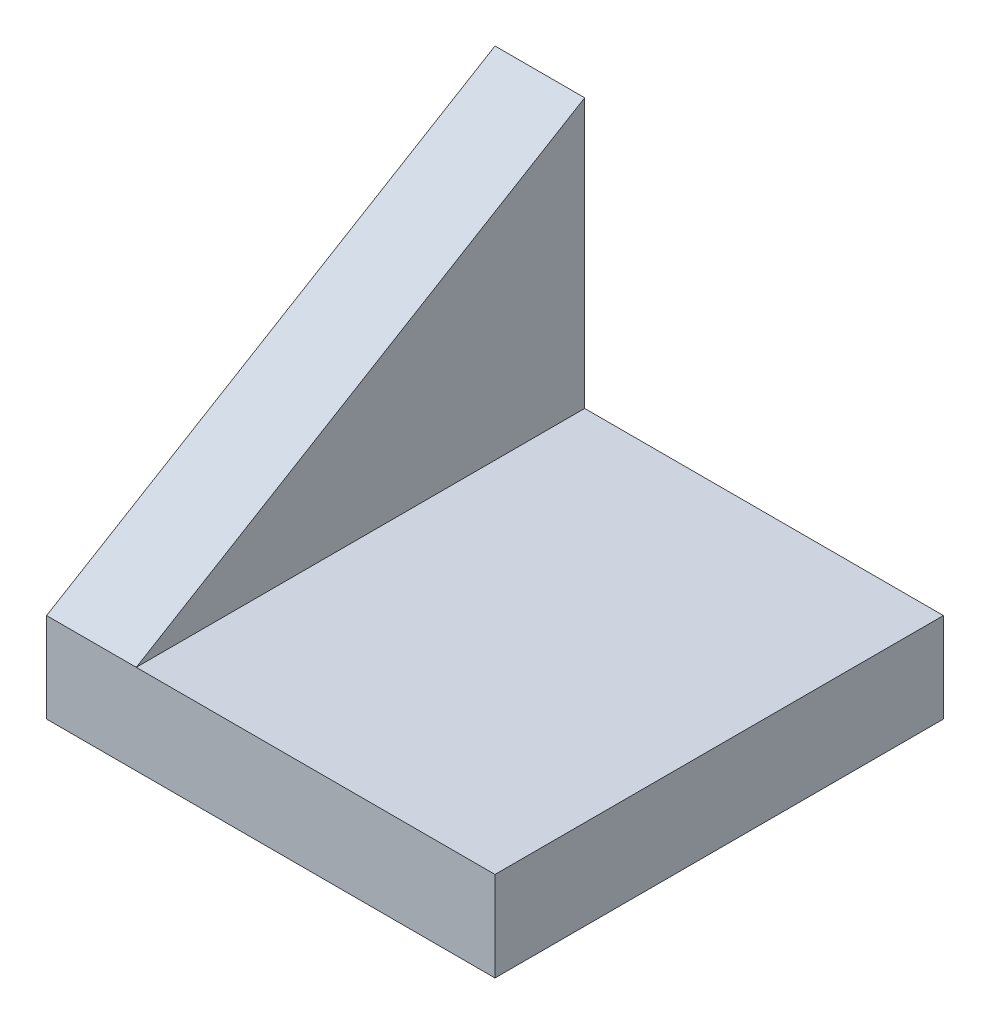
ISO-10303-21;
HEADER;
FILE_DESCRIPTION(('STEP AP214'),'2;1');
FILE_NAME('part.step','',(''),(''),'','','');
FILE_SCHEMA(('AUTOMOTIVE_DESIGN { 1 0 10303 214 1 1 1 1 }'));
ENDSEC;
DATA;
#1=APPLICATION_CONTEXT('core data for automotive mechanical design processes');
#2=APPLICATION_PROTOCOL_DEFINITION('international standard','automotive_design',2000,#1);
#3=PRODUCT_CONTEXT('',#1,'mechanical');
#4=PRODUCT('Part','Part','',(#3));
#5=PRODUCT_RELATED_PRODUCT_CATEGORY('part','',(#4));
#6=PRODUCT_DEFINITION_FORMATION('','',#4);
#7=PRODUCT_DEFINITION_CONTEXT('part definition',#1,'design');
#8=PRODUCT_DEFINITION('design','',#6,#7);
#9=PRODUCT_DEFINITION_SHAPE('','',#8);
#10=(LENGTH_UNIT() NAMED_UNIT(*) SI_UNIT(.MILLI.,.METRE.));
#11=(NAMED_UNIT(*) PLANE_ANGLE_UNIT() SI_UNIT($,.RADIAN.));
#12=(NAMED_UNIT(*) SI_UNIT($,.STERADIAN.) SOLID_ANGLE_UNIT());
#13=UNCERTAINTY_MEASURE_WITH_UNIT(LENGTH_MEASURE(1.E-05),#10,'distance_accuracy_value','');
#14=(GEOMETRIC_REPRESENTATION_CONTEXT(3) GLOBAL_UNCERTAINTY_ASSIGNED_CONTEXT((#13)) GLOBAL_UNIT_ASSIGNED_CONTEXT((#10,
#11,#12)) REPRESENTATION_CONTEXT('',''));
#15=CARTESIAN_POINT('',(0.,0.,0.));
#16=DIRECTION('',(0.,0.,1.));
#17=DIRECTION('',(1.,0.,0.));
#18=AXIS2_PLACEMENT_3D('',#15,#16,#17);
#19=CARTESIAN_POINT('',(-25.9453781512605,10.,-18.2773109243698));
#20=DIRECTION('',(0.,0.,-1.));
#21=DIRECTION('',(-1.,0.,0.));
#22=AXIS2_PLACEMENT_3D('',#19,#20,#21);
#23=PLANE('',#22);
#24=DIRECTION('',(1.,0.,0.));
#25=VECTOR('',#24,1.);
#26=CARTESIAN_POINT('',(-25.9453781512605,0.,-18.2773109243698));
#27=LINE('',#26,#25);
#28=CARTESIAN_POINT('',(-25.9453781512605,0.,-18.2773109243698));
#29=VERTEX_POINT('',#28);
#30=CARTESIAN_POINT('',(24.0546218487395,0.,-18.2773109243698));
#31=VERTEX_POINT('',#30);
#32=EDGE_CURVE('E93',#29,#31,#27,.T.);
#33=ORIENTED_EDGE('',*,*,#32,.F.);
#34=DIRECTION('',(0.,-1.,0.));
#35=VECTOR('',#34,1.);
#36=CARTESIAN_POINT('',(-25.9453781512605,10.,-18.2773109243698));
#37=LINE('',#36,#35);
#38=CARTESIAN_POINT('',(-25.9453781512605,40.,-18.2773109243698));
#39=VERTEX_POINT('',#38);
#40=EDGE_CURVE('E11',#39,#29,#37,.T.);
#41=ORIENTED_EDGE('',*,*,#40,.F.);
#42=DIRECTION('',(-1.,0.,0.));
#43=VECTOR('',#42,1.);
#44=CARTESIAN_POINT('',(-15.9453781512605,40.,-18.2773109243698));
#45=LINE('',#44,#43);
#46=CARTESIAN_POINT('',(-15.9453781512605,40.,-18.2773109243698));
#47=VERTEX_POINT('',#46);
#48=EDGE_CURVE('E101',#47,#39,#45,.T.);
#49=ORIENTED_EDGE('',*,*,#48,.F.);
#50=DIRECTION('',(0.,-1.,0.));
#51=VECTOR('',#50,1.);
#52=CARTESIAN_POINT('',(-15.9453781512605,10.,-18.2773109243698));
#53=LINE('',#52,#51);
#54=CARTESIAN_POINT('',(-15.9453781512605,10.,-18.2773109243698));
#55=VERTEX_POINT('',#54);
#56=EDGE_CURVE('E104',#47,#55,#53,.T.);
#57=ORIENTED_EDGE('',*,*,#56,.T.);
#58=DIRECTION('',(1.,0.,0.));
#59=VECTOR('',#58,1.);
#60=CARTESIAN_POINT('',(-25.9453781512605,10.,-18.2773109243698));
#61=LINE('',#60,#59);
#62=CARTESIAN_POINT('',(24.0546218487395,10.,-18.2773109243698));
#63=VERTEX_POINT('',#62);
#64=EDGE_CURVE('E96',#55,#63,#61,.T.);
#65=ORIENTED_EDGE('',*,*,#64,.T.);
#66=DIRECTION('',(0.,-1.,0.));
#67=VECTOR('',#66,1.);
#68=CARTESIAN_POINT('',(24.0546218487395,10.,-18.2773109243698));
#69=LINE('',#68,#67);
#70=EDGE_CURVE('E35',#63,#31,#69,.T.);
#71=ORIENTED_EDGE('',*,*,#70,.T.);
#72=EDGE_LOOP('',(#33,#41,#49,#57,#65,#71));
#73=FACE_BOUND('',#72,.T.);
#74=ADVANCED_FACE('F32',(#73),#23,.T.);
#75=CARTESIAN_POINT('',(-25.9453781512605,10.,-18.2773109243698));
#76=DIRECTION('',(1.,0.,0.));
#77=DIRECTION('',(0.,0.,-1.));
#78=AXIS2_PLACEMENT_3D('',#75,#76,#77);
#79=PLANE('',#78);
#80=DIRECTION('',(0.,0.,1.));
#81=VECTOR('',#80,1.);
#82=CARTESIAN_POINT('',(-25.9453781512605,0.,-18.2773109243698));
#83=LINE('',#82,#81);
#84=CARTESIAN_POINT('',(-25.9453781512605,0.,31.7226890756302));
#85=VERTEX_POINT('',#84);
#86=EDGE_CURVE('E79',#29,#85,#83,.T.);
#87=ORIENTED_EDGE('',*,*,#86,.T.);
#88=DIRECTION('',(0.,-1.,0.));
#89=VECTOR('',#88,1.);
#90=CARTESIAN_POINT('',(-25.9453781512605,10.,31.7226890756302));
#91=LINE('',#90,#89);
#92=CARTESIAN_POINT('',(-25.9453781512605,10.,31.7226890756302));
#93=VERTEX_POINT('',#92);
#94=EDGE_CURVE('E40',#93,#85,#91,.T.);
#95=ORIENTED_EDGE('',*,*,#94,.F.);
#96=DIRECTION('',(0.,0.514495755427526,-0.857492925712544));
#97=VECTOR('',#96,1.);
#98=CARTESIAN_POINT('',(-25.9453781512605,40.,-18.2773109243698));
#99=LINE('',#98,#97);
#100=EDGE_CURVE('E83',#93,#39,#99,.T.);
#101=ORIENTED_EDGE('',*,*,#100,.T.);
#102=ORIENTED_EDGE('',*,*,#40,.T.);
#103=EDGE_LOOP('',(#87,#95,#101,#102));
#104=FACE_BOUND('',#103,.T.);
#105=ADVANCED_FACE('F77',(#104),#79,.F.);
#106=CARTESIAN_POINT('',(-25.9453781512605,10.,31.7226890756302));
#107=DIRECTION('',(0.,0.,-1.));
#108=DIRECTION('',(-1.,0.,0.));
#109=AXIS2_PLACEMENT_3D('',#106,#107,#108);
#110=PLANE('',#109);
#111=DIRECTION('',(1.,0.,0.));
#112=VECTOR('',#111,1.);
#113=CARTESIAN_POINT('',(-25.9453781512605,0.,31.7226890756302));
#114=LINE('',#113,#112);
#115=CARTESIAN_POINT('',(24.0546218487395,0.,31.7226890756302));
#116=VERTEX_POINT('',#115);
#117=EDGE_CURVE('E95',#85,#116,#114,.T.);
#118=ORIENTED_EDGE('',*,*,#117,.T.);
#119=DIRECTION('',(0.,-1.,0.));
#120=VECTOR('',#119,1.);
#121=CARTESIAN_POINT('',(24.0546218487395,10.,31.7226890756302));
#122=LINE('',#121,#120);
#123=CARTESIAN_POINT('',(24.0546218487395,10.,31.7226890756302));
#124=VERTEX_POINT('',#123);
#125=EDGE_CURVE('E111',#124,#116,#122,.T.);
#126=ORIENTED_EDGE('',*,*,#125,.F.);
#127=DIRECTION('',(1.,0.,0.));
#128=VECTOR('',#127,1.);
#129=CARTESIAN_POINT('',(-25.9453781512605,10.,31.7226890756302));
#130=LINE('',#129,#128);
#131=CARTESIAN_POINT('',(-15.9453781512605,10.,31.7226890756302));
#132=VERTEX_POINT('',#131);
#133=EDGE_CURVE('E57',#132,#124,#130,.T.);
#134=ORIENTED_EDGE('',*,*,#133,.F.);
#135=EDGE_CURVE('E107',#93,#132,#130,.T.);
#136=ORIENTED_EDGE('',*,*,#135,.F.);
#137=ORIENTED_EDGE('',*,*,#94,.T.);
#138=EDGE_LOOP('',(#118,#126,#134,#136,#137));
#139=FACE_BOUND('',#138,.T.);
#140=ADVANCED_FACE('F127',(#139),#110,.F.);
#141=CARTESIAN_POINT('',(24.0546218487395,10.,-18.2773109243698));
#142=DIRECTION('',(1.,0.,0.));
#143=DIRECTION('',(0.,0.,-1.));
#144=AXIS2_PLACEMENT_3D('',#141,#142,#143);
#145=PLANE('',#144);
#146=DIRECTION('',(0.,0.,1.));
#147=VECTOR('',#146,1.);
#148=CARTESIAN_POINT('',(24.0546218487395,0.,-18.2773109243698));
#149=LINE('',#148,#147);
#150=EDGE_CURVE('E100',#31,#116,#149,.T.);
#151=ORIENTED_EDGE('',*,*,#150,.F.);
#152=ORIENTED_EDGE('',*,*,#70,.F.);
#153=DIRECTION('',(0.,0.,1.));
#154=VECTOR('',#153,1.);
#155=CARTESIAN_POINT('',(24.0546218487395,10.,-18.2773109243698));
#156=LINE('',#155,#154);
#157=EDGE_CURVE('E116',#63,#124,#156,.T.);
#158=ORIENTED_EDGE('',*,*,#157,.T.);
#159=ORIENTED_EDGE('',*,*,#125,.T.);
#160=EDGE_LOOP('',(#151,#152,#158,#159));
#161=FACE_BOUND('',#160,.T.);
#162=ADVANCED_FACE('F129',(#161),#145,.T.);
#163=CARTESIAN_POINT('',(0.,10.,0.));
#164=DIRECTION('',(0.,-1.,0.));
#165=DIRECTION('',(0.,0.,-1.));
#166=AXIS2_PLACEMENT_3D('',#163,#164,#165);
#167=PLANE('',#166);
#168=ORIENTED_EDGE('',*,*,#64,.F.);
#169=DIRECTION('',(0.,0.,1.));
#170=VECTOR('',#169,1.);
#171=CARTESIAN_POINT('',(-15.9453781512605,10.,31.7226890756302));
#172=LINE('',#171,#170);
#173=EDGE_CURVE('E120',#55,#132,#172,.T.);
#174=ORIENTED_EDGE('',*,*,#173,.T.);
#175=ORIENTED_EDGE('',*,*,#133,.T.);
#176=ORIENTED_EDGE('',*,*,#157,.F.);
#177=EDGE_LOOP('',(#168,#174,#175,#176));
#178=FACE_BOUND('',#177,.T.);
#179=ADVANCED_FACE('F125',(#178),#167,.F.);
#180=CARTESIAN_POINT('',(0.,0.,0.));
#181=DIRECTION('',(0.,-1.,0.));
#182=DIRECTION('',(0.,0.,-1.));
#183=AXIS2_PLACEMENT_3D('',#180,#181,#182);
#184=PLANE('',#183);
#185=ORIENTED_EDGE('',*,*,#32,.T.);
#186=ORIENTED_EDGE('',*,*,#150,.T.);
#187=ORIENTED_EDGE('',*,*,#117,.F.);
#188=ORIENTED_EDGE('',*,*,#86,.F.);
#189=EDGE_LOOP('',(#185,#186,#187,#188));
#190=FACE_BOUND('',#189,.T.);
#191=ADVANCED_FACE('F91',(#190),#184,.T.);
#192=CARTESIAN_POINT('',(-15.9453781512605,40.,-18.2773109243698));
#193=DIRECTION('',(0.,0.857492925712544,0.514495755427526));
#194=DIRECTION('',(0.,-0.514495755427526,0.857492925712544));
#195=AXIS2_PLACEMENT_3D('',#192,#193,#194);
#196=PLANE('',#195);
#197=ORIENTED_EDGE('',*,*,#100,.F.);
#198=ORIENTED_EDGE('',*,*,#135,.T.);
#199=DIRECTION('',(0.,0.514495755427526,-0.857492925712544));
#200=VECTOR('',#199,1.);
#201=CARTESIAN_POINT('',(-15.9453781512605,40.,-18.2773109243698));
#202=LINE('',#201,#200);
#203=EDGE_CURVE('E48',#132,#47,#202,.T.);
#204=ORIENTED_EDGE('',*,*,#203,.T.);
#205=ORIENTED_EDGE('',*,*,#48,.T.);
#206=EDGE_LOOP('',(#197,#198,#204,#205));
#207=FACE_BOUND('',#206,.T.);
#208=ADVANCED_FACE('F146',(#207),#196,.T.);
#209=CARTESIAN_POINT('',(-15.9453781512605,0.,0.));
#210=DIRECTION('',(1.,0.,0.));
#211=DIRECTION('',(0.,0.,-1.));
#212=AXIS2_PLACEMENT_3D('',#209,#210,#211);
#213=PLANE('',#212);
#214=ORIENTED_EDGE('',*,*,#173,.F.);
#215=ORIENTED_EDGE('',*,*,#56,.F.);
#216=ORIENTED_EDGE('',*,*,#203,.F.);
#217=EDGE_LOOP('',(#214,#215,#216));
#218=FACE_BOUND('',#217,.T.);
#219=ADVANCED_FACE('F150',(#218),#213,.T.);
#220=CLOSED_SHELL('',(#74,#105,#140,#162,#179,#191,#208,#219));
#221=MANIFOLD_SOLID_BREP('B2',#220);
#222=ADVANCED_BREP_SHAPE_REPRESENTATION('',(#18,#221),#14);
#223=SHAPE_DEFINITION_REPRESENTATION(#9,#222);
ENDSEC;
END-ISO-10303-21;
